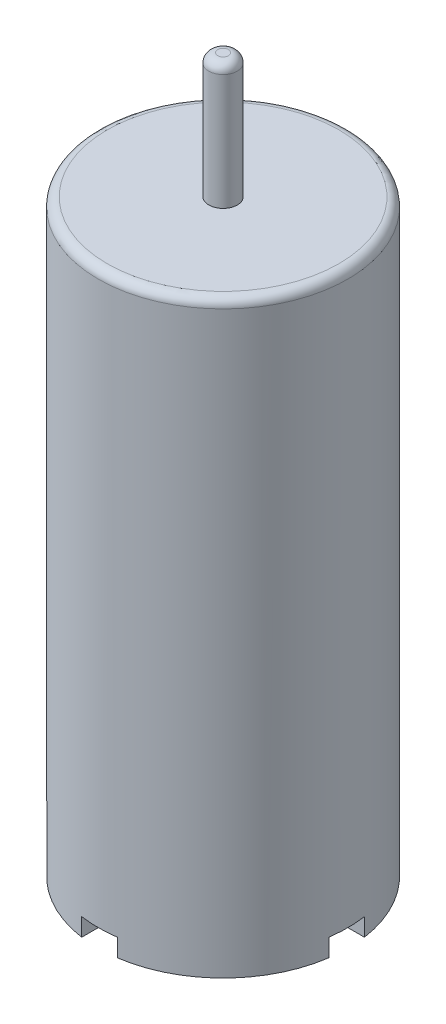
from build123d import *

# Parameters (mm, degrees)
SKETCH1_R           = 3.5
BOSS_EXTRUDE1_DEPTH = 16
BOSS_EXTRUDE2_START = 0.5
BOSS_EXTRUDE2_DEPTH = 0.5
SKETCH3_R           = 0.4
BOSS_EXTRUDE3_DEPTH = 3.5
FILLET2_R           = 0.25
FILLET3_R           = 0.25


with BuildPart() as part:
    # Sketch1 → Boss-Extrude1 (new body)
    with BuildSketch(Plane(origin=(0, 0, 0), x_dir=(1, 0, 0), z_dir=(0, 1, 0))):
        with Locations(Location((0, 0, 0), (0, 0, 270))):
            Circle(SKETCH1_R)
    extrude(amount=BOSS_EXTRUDE1_DEPTH)

    # Sketch2 → Boss-Extrude2 (add)
    with BuildSketch(Plane.XZ.offset(BOSS_EXTRUDE2_START)):
        with BuildLine():
            Line((-0.5, 2.964101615), (0.5, 2.964101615))
            Line((0.5, 2.964101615), (0.5, 3.464101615))
            ThreePointArc((0.5, 3.464101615), (2.474873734, 2.474873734), (3.464101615, 0.5))
            Line((3.464101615, 0.5), (2.964101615, 0.5))
            Line((2.964101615, 0.5), (2.964101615, -0.5))
            Line((2.964101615, -0.5), (3.464101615, -0.5))
            ThreePointArc((3.464101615, -0.5), (2.474873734, -2.474873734), (0.5, -3.464101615))
            Line((0.5, -3.464101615), (0.5, -2.964101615))
            Line((0.5, -2.964101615), (-0.5, -2.964101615))
            Line((-0.5, -2.964101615), (-0.5, -3.464101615))
            ThreePointArc((-0.5, -3.464101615), (-2.474873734, -2.474873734), (-3.464101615, -0.5))
            Line((-3.464101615, -0.5), (-2.964101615, -0.5))
            Line((-2.964101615, -0.5), (-2.964101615, 0.5))
            Line((-2.964101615, 0.5), (-3.464101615, 0.5))
            ThreePointArc((-3.464101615, 0.5), (-2.474873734, 2.474873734), (-0.5, 3.464101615))
            Line((-0.5, 3.464101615), (-0.5, 2.964101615))
        make_face()
    extrude(amount=-BOSS_EXTRUDE2_DEPTH)

    # Sketch3 → Boss-Extrude3 (add)
    with BuildSketch(Plane(origin=(0, 16, 0), x_dir=(1, 0, 0), z_dir=(0, 1, 0))):
        with Locations(Location((0, 0, 0), (0, 0, 270))):
            Circle(SKETCH3_R)
    extrude(amount=BOSS_EXTRUDE3_DEPTH)

    # Fillet2
    fillet2_edges = [part.edges().sort_by_distance(p)[0] for p in [
        (0, 16, -3.5),
    ]]
    fillet(fillet2_edges, radius=FILLET2_R)

    # Fillet3
    fillet3_edges = [part.edges().sort_by_distance(p)[0] for p in [
        (0, 19.5, -0.4),
    ]]
    fillet(fillet3_edges, radius=FILLET3_R)


solid = part.part
